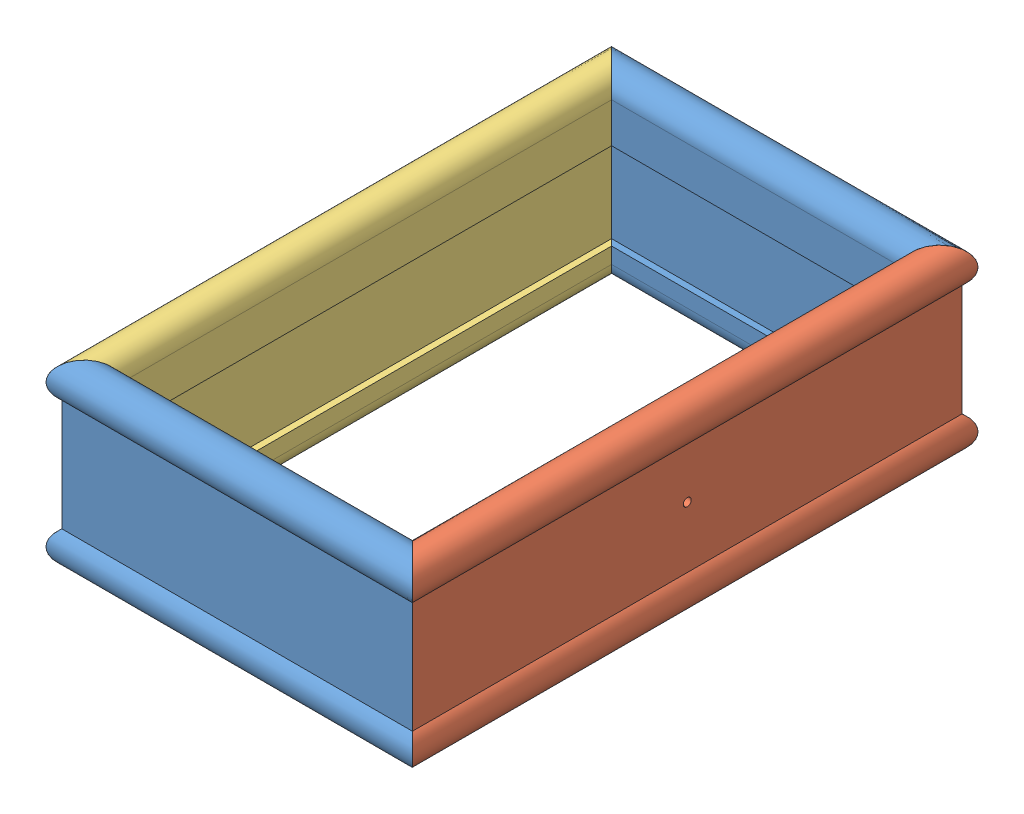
SolidWorks assembly Frame Assembly.SLDASM, configuration Default (file format 6000). Lengths in mm.
Overall size (230 113.5 355).
4 component instances, 3 part files, 9 mates.
Components (placement in the parent):
- Frame End-1: Frame End.SLDPRT [Default] at (-21.2931 -3.8939 0.0877) size (230 113.5 24)
- Frame End-2: Frame End.SLDPRT [Default] at (-21.2931 -3.8939 345.0877) x (-1 0 0) z (0 0 -1) size (230 113.5 24)
- Frame Side Right-1: Frame Side Right.SLDPRT [Default] at (88.7069 -3.8939 172.5877) x (0 0 1) z (-1 0 0) size (355 113.5 24)
- Frame Side Left-1: Frame Side Left.SLDPRT [Default] at (-131.2931 -3.8939 172.5877) x (0 0 -1) z (1 0 0) size (355 113.5 24)
Mates (geometry in assembly coordinates):
- Coincident5: coincident anti-aligned: plane of Frame End-1 through (69.7069 -53.1439 19.0877) normal (0.707107 0 0.707107); plane of Frame Side Right-1 through (93.7069 -53.1439 -4.9123) normal (-0.707107 0 -0.707107)
- Coincident6: coincident aligned: plane of Frame End-1 through (137.809 23.3561 15.0877) normal (0 -1 0); plane of Frame Side Right-1 through (73.7069 23.3561 394.1898) normal (0 -1 0)
- Coincident7: coincident aligned: line of Frame End-1 through (69.7069 23.3561 19.0877) axis (0 1 0); line of Frame Side Right-1 through (69.7069 23.3561 19.0877) axis (0 1 0)
- Coincident8: coincident anti-aligned: plane of Frame End-2 through (93.7069 -53.1439 350.0877) normal (0.707107 0 -0.707107); plane of Frame Side Right-1 through (69.7069 -53.1439 326.0877) normal (-0.707107 0 0.707107)
- Coincident9: coincident aligned: plane of Frame End-2 through (-180.3953 23.3561 330.0877) normal (0 -1 0); plane of Frame Side Right-1 through (73.7069 23.3561 394.1898) normal (0 -1 0)
- Coincident10: coincident aligned: line of Frame End-2 through (69.7069 23.3561 326.0877) axis (0 1 0); line of Frame Side Right-1 through (69.7069 23.3561 326.0877) axis (0 1 0)
- Coincident11: coincident anti-aligned: plane of Frame End-1 through (-136.2931 -53.1439 -4.9123) normal (-0.707107 0 0.707107); plane of Frame Side Left-1 through (-112.2931 -53.1439 19.0877) normal (0.707107 0 -0.707107)
- Coincident12: coincident anti-aligned: plane of Frame End-2 through (-112.2931 -53.1439 326.0877) normal (-0.707107 0 -0.707107); plane of Frame Side Left-1 through (-136.2931 -53.1439 350.0877) normal (0.707107 0 0.707107)
- Coincident13: coincident aligned: plane of Frame End-2 through (-180.3953 23.3561 330.0877) normal (0 -1 0); plane of Frame Side Left-1 through (-116.2931 23.3561 -49.0145) normal (0 -1 0)
